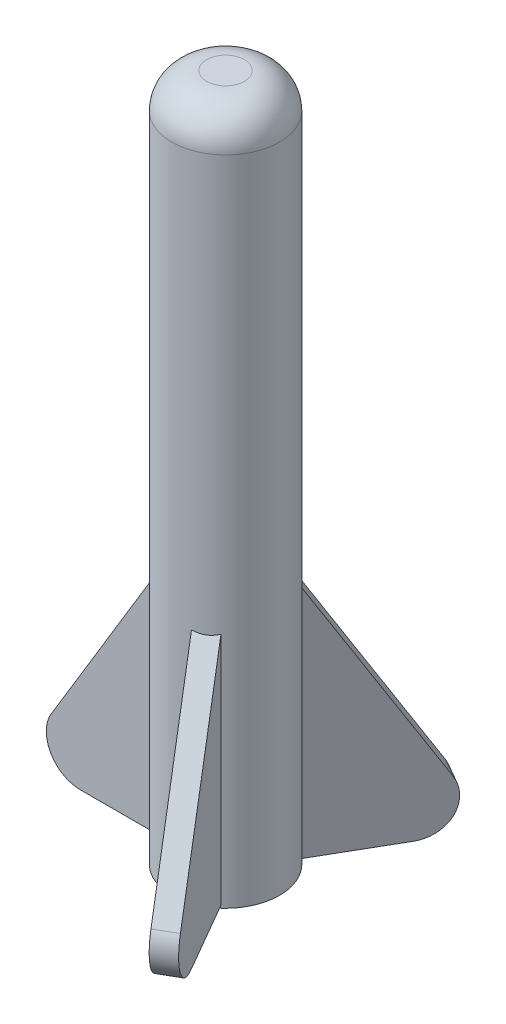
from build123d import *

# Parameters (mm, degrees)
SKETCH1_R           = 5.08
BASE_EXTRUDE_DEPTH  = 64.77
FILLET1_R           = 3.302
SKETCH4_W           = 2.794
SKETCH4_H           = 33.0835
BOSS_EXTRUDE1_DEPTH = 1.016
CIRPATTERN1_COUNT   = 3


with BuildPart() as part:
    # Sketch1 → Base-Extrude (new body)
    with BuildSketch(Plane(origin=(0, 0, 0), x_dir=(1, 0, 0), z_dir=(0, 1, 0))):
        with Locations(Location((0, 0, 0), (0, 0, 270))):
            Circle(SKETCH1_R)
    extrude(amount=BASE_EXTRUDE_DEPTH)

    # Fillet1
    fillet1_edges = [part.edges().sort_by_distance(p)[0] for p in [
        (0, 64.77, -5.08),
    ]]
    fillet(fillet1_edges, radius=FILLET1_R)

    # Sketch4 → Cut-Revolve1 (revolve, cut)
    with BuildSketch(Plane.XY, mode=Mode.PRIVATE) as cut_revolve1_sk:
        with Locations((-1.397, 16.54175)):
            Rectangle(SKETCH4_W, SKETCH4_H)
    revolve(cut_revolve1_sk.sketch.rotate(Axis((0, 33.0835, 0), (0, 1, 0)), 180), axis=Axis((0, 33.0835, 0), (0, 1, 0)), mode=Mode.SUBTRACT)

    # Sketch3 → Boss-Extrude1 (add, symmetric)
    with BuildSketch(Plane.XY):
        with BuildLine():
            Line((-4.826, 0.254), (-12.7, 0.254))
            ThreePointArc((-12.7, 0.254), (-15.465187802, 1.868755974), (-15.417711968, 5.070543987))
            Line((-15.417711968, 5.070543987), (-4.826, 22.606))
            Line((-4.826, 22.606), (-4.826, 0.254))
        make_face()
    boss_extrude1 = extrude(amount=BOSS_EXTRUDE1_DEPTH, both=True)

    # CirPattern1: Boss-Extrude1 ×3 about axis
    cirpattern1_axis = Axis((0, 0, 0), (0, 1, 0))
    for i in range(1, CIRPATTERN1_COUNT):
        add(boss_extrude1.rotate(cirpattern1_axis, i * 360 / CIRPATTERN1_COUNT))


solid = part.part
